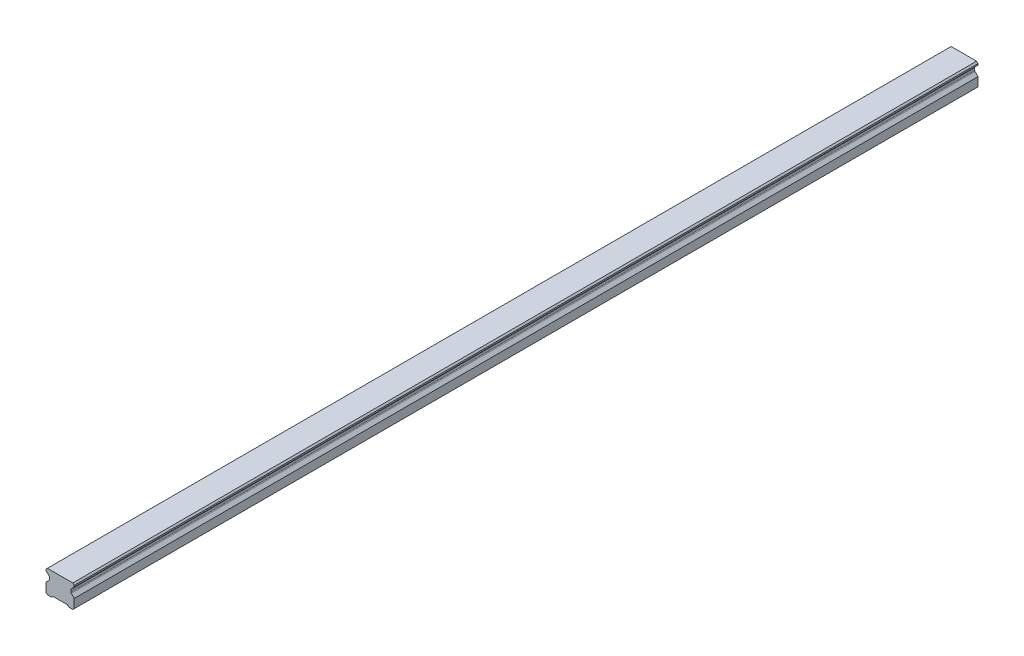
from build123d import *

# Parameters (mm, degrees)
SKETCH1_W           = 20
SKETCH1_H           = 16.3
BOSS_EXTRUDE1_DEPTH = 320
CUT_EXTRUDE1_DEPTH  = 641.285631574
CHAMFER1_SIZE       = 1
FILLET1_R           = 1
CUT_EXTRUDE2_DEPTH  = 641.285631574
SKETCH5_R           = 3
SKETCH5_R_2         = 2.5
CUT_EXTRUDE5_DEPTH  = 10
SKETCH5_2_R         = 2.5
CUT_EXTRUDE6_DEPTH  = 13
LPATTERN2_COUNT     = 11
LPATTERN2_PITCH     = 60


with BuildPart() as part:
    # Sketch1 → Boss-Extrude1 (new, symmetric)
    with BuildSketch(Plane.XY):
        with Locations((0, 8.15)):
            Rectangle(SKETCH1_W, SKETCH1_H)
    extrude(amount=BOSS_EXTRUDE1_DEPTH, both=True)

    # Sketch2 → Cut-Extrude1 (cut, through all)
    with BuildSketch(Plane.XY.offset(320)):
        Polygon((-10, 14.3), (-10, 7.3), (-7.666666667, 9.633333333), (-7.666666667, 11.966666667), align=None)
        Polygon((7.666666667, 11.966666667), (10, 14.3), (10, 7.3), (7.666666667, 9.633333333), align=None)
    extrude(amount=-CUT_EXTRUDE1_DEPTH, mode=Mode.SUBTRACT)

    # Chamfer1
    chamfer1_edges = [part.edges().sort_by_distance(p)[0] for p in [
        (-10, 16.3, 0),
        (10, 16.3, 0),
        (10, 0, 0),
        (-10, 0, 0),
    ]]
    chamfer(chamfer1_edges, length=CHAMFER1_SIZE)

    # Fillet1
    fillet1_edges = [part.edges().sort_by_distance(p)[0] for p in [
        (-7.666666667, 11.966666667, 0),
        (-7.666666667, 9.633333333, 0),
        (7.666666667, 9.633333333, 0),
        (7.666666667, 11.966666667, 0),
    ]]
    fillet(fillet1_edges, radius=FILLET1_R)

    # Sketch3 → Cut-Extrude2 (cut, through all)
    with BuildSketch(Plane.XY.offset(320)):
        Polygon((-6, 0), (-5, 1), (5, 1), (6, 0), align=None)
    extrude(amount=-CUT_EXTRUDE2_DEPTH, mode=Mode.SUBTRACT)

    # Sketch5 → Cut-Extrude5 (cut)
    with BuildSketch(Plane.XZ.offset(-1)):
        with Locations(Location((0, 300, 0), (0, 0, 270))):
            Circle(SKETCH5_R)
        with Locations(Location((0, 300, 0), (0, 0, 270))):
            Circle(SKETCH5_R_2, mode=Mode.SUBTRACT)
    cut_extrude5 = extrude(amount=-CUT_EXTRUDE5_DEPTH, mode=Mode.SUBTRACT)

    # Sketch5_2 → Cut-Extrude6 (cut)
    with BuildSketch(Plane.XZ.offset(-1)):
        with Locations(Location((0, 300, 0), (0, 0, 270))):
            Circle(SKETCH5_2_R)
    cut_extrude6 = extrude(amount=-CUT_EXTRUDE6_DEPTH, mode=Mode.SUBTRACT)

    # Cut-Extrude7 cone 1 section (on through the dimple's axis) → Cut-Extrude7 (revolve, cut)
    with BuildSketch(Plane(origin=(0, 14, 300), x_dir=(0, 0, -1), z_dir=(1, 0, 0))):
        Polygon((0, 0), (2.5, 0), (0, 1.443375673), align=None)
    cut_extrude7 = revolve(axis=Axis((0, 14, 300), (0, 1, 0)), mode=Mode.SUBTRACT)

    # LPattern2: Cut-Extrude5, Cut-Extrude6, Cut-Extrude7 ×11
    with Locations(*[(0, 0, -i * LPATTERN2_PITCH) for i in range(1, LPATTERN2_COUNT)]):
        add(cut_extrude5, mode=Mode.SUBTRACT)
        add(cut_extrude6, mode=Mode.SUBTRACT)
        add(cut_extrude7, mode=Mode.SUBTRACT)


solid = part.part
